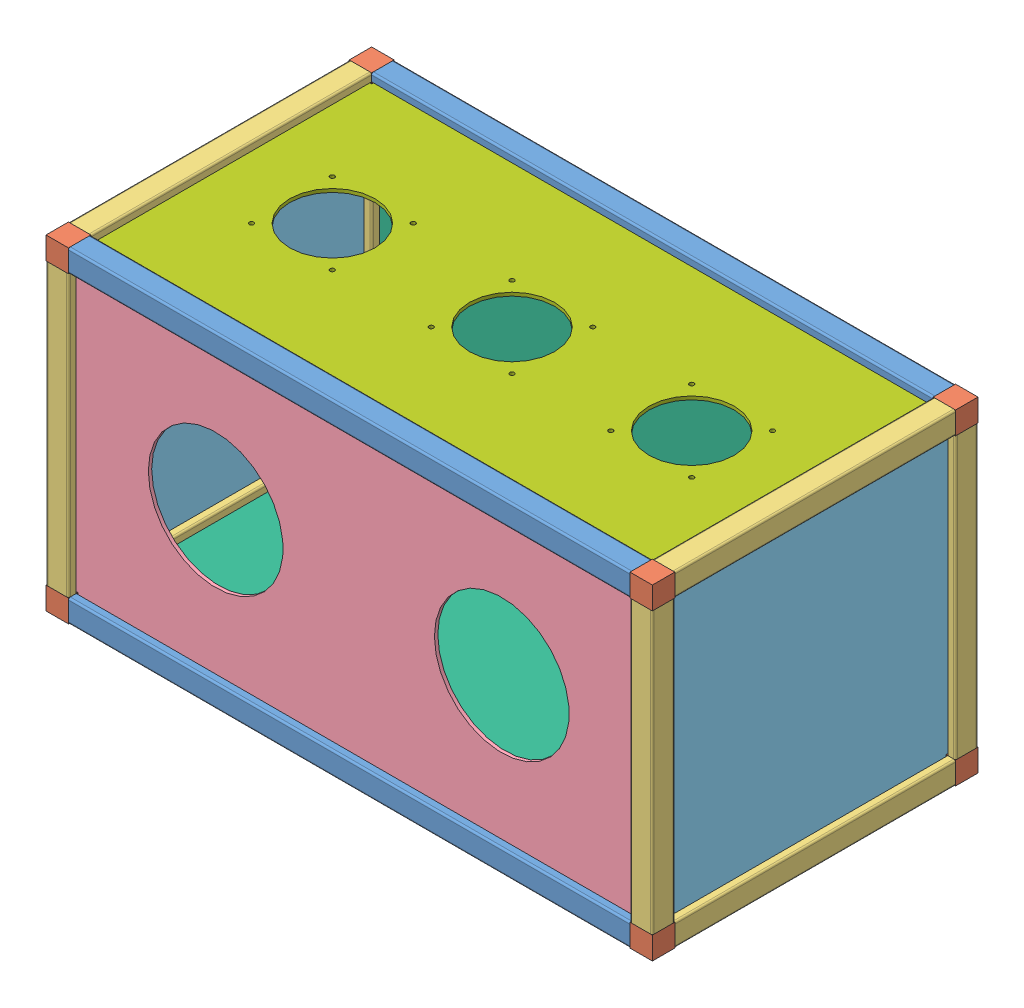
SolidWorks assembly Assy06.SLDASM, configuration Défaut (file format 9000). Lengths in mm.
Overall size (540 290 290).
26 component instances, 7 part files, 78 mates.
Components (placement in the parent):
- Profile20x20x500-1: Profile20x20x500.SLDPRT [Default] at (499 10 -10) x (0 1 0) z (1 0 0) size (20 20 500)
- Cube-1: Cube.SLDPRT [Défaut] at (-10 10 -10) size (26 26 26)
- Cube-2: Cube.SLDPRT [Défaut] at (510 10 -10) x (0 1 0) z (0 0 1) size (26 26 26)
- Profile20x20x250-1: Profile20x20x250.SLDPRT [Default] at (-10 10 -21) x (0 1 0) z (0 0 1) size (20 20 250)
- Profile20x20x250-2: Profile20x20x250.SLDPRT [Default] at (510 10 -21) x (-1 0 0) z (0 0 1) size (20 20 250)
- Cube-3: Cube.SLDPRT [Défaut] at (-10 10 -280) x (0 0 1) z (-1 0 0) size (26 26 26)
- Profile20x20x500-2: Profile20x20x500.SLDPRT [Default] at (1 10 -280) x (0 1 0) z (-1 0 0) size (20 20 500)
- Cube-4: Cube.SLDPRT [Défaut] at (510 10 -280) x (0 0 1) z (0 -1 0) size (26 26 26)
- Profile20x20x250-3: Profile20x20x250.SLDPRT [Default] at (-10 21 -10) x (1 0 0) z (0 -1 0) size (20 20 250)
- Profile20x20x250-4: Profile20x20x250.SLDPRT [Default] at (510 21 -10) x (0 0 -1) z (0 -1 0) size (20 20 250)
- Front-1: Front.SLDPRT [Défaut] at (250 145 -11.5) size (509.6 259.6 3)
- Profile20x20x250-5: Profile20x20x250.SLDPRT [Default] at (-10 21 -280) x (0 0 1) z (0 -1 0) size (20 20 250)
- Profile20x20x250-6: Profile20x20x250.SLDPRT [Default] at (510 21 -280) x (-1 0 0) z (0 -1 0) size (20 20 250)
- Side-1: Side.SLDPRT [Défaut] at (511.5 145 -145) x (0 0 1) z (-1 0 0) size (259.6 259.6 3)
- Side-2: Side.SLDPRT [Défaut] at (-11.5 145 -145) x (0 0 -1) z (1 0 0) size (259.6 259.6 3)
- Panel-1: Panel.SLDPRT [Défaut] at (250 145 -281.5) size (509.6 259.6 3)
- Panel-2: Panel.SLDPRT [Défaut] at (250 11.5 -145) x (1 0 0) z (0 -1 0) size (509.6 259.6 3)
- Cube-5: Cube.SLDPRT [Défaut] at (-10 280 -280) x (0 -1 0) z (-1 0 0) size (26 26 26)
- Cube-6: Cube.SLDPRT [Défaut] at (510 280 -280) x (0 0 1) z (1 0 0) size (26 26 26)
- Cube-7: Cube.SLDPRT [Défaut] at (-10 280 -10) x (0 -1 0) z (0 0 1) size (26 26 26)
- Cube-8: Cube.SLDPRT [Défaut] at (510 280 -10) x (0 -1 0) z (1 0 0) size (26 26 26)
- Profile20x20x250-7: Profile20x20x250.SLDPRT [Default] at (-10 280 -21) size (20 20 250)
- Profile20x20x250-8: Profile20x20x250.SLDPRT [Default] at (510 280 -269) x (-1 0 0) z (0 0 -1) size (20 20 250)
- Profile20x20x500-3: Profile20x20x500.SLDPRT [Default] at (499 280 -10) x (0 0 -1) z (1 0 0) size (20 20 500)
- Profile20x20x500-4: Profile20x20x500.SLDPRT [Default] at (1 280 -280) x (0 0 1) z (-1 0 0) size (20 20 500)
- Top-1: Top.SLDPRT [Défaut] at (250 278.5 -145) x (1 0 0) z (0 1 0) size (509.6 259.6 3)
Mates (geometry in assembly coordinates):
- Coïncidente1: coincident aligned: plane of Profile20x20x500-1 through (0 18.4 0) normal (0 0 1); plane of assembly through (0 0 0) normal (0 0 1)
- Coïncidente2: coincident anti-aligned: plane of Profile20x20x500-1 through (0 0 -1.6) normal (0 -1 0); plane of assembly through (0 0 0) normal (0 1 0)
- Coïncidente4: coincident anti-aligned: plane of Profile20x20x500-1 through (0 1.6 -1.6) normal (-1 0 0); plane of assembly through (0 0 0) normal (1 0 0)
- Coïncidente5: coincident aligned: plane of Profile20x20x500-1 through (0 18.4 0) normal (0 0 1); plane of Cube-1 through (-10 10 0) normal (0 0 1)
- Coïncidente6: coincident aligned: plane of Profile20x20x500-1 through (0 0 -1.6) normal (0 -1 0); plane of Cube-1 through (-20 0 -20) normal (0 -1 0)
- Distance2: distance anti-aligned: plane of Cube-1 through (0 0 -20) normal (1 0 0); plane of Profile20x20x500-1 through (0 1.6 -1.6) normal (-1 0 0)
- Distance3: distance anti-aligned: plane of Cube-2 through (500 0 -20) normal (-1 0 0); plane of Profile20x20x500-1 through (500 1.6 -1.6) normal (1 0 0)
- Coïncidente9: coincident aligned: plane of Profile20x20x500-1 through (0 18.4 0) normal (0 0 1); plane of Cube-2 through (510 10 0) normal (0 0 1)
- Coïncidente10: coincident aligned: plane of Profile20x20x500-1 through (0 0 -1.6) normal (0 -1 0); plane of Cube-2 through (520 0 -20) normal (0 -1 0)
- Coïncidente11: coincident aligned: plane of Cube-1 through (-20 0 -20) normal (-1 0 0); plane of Profile20x20x250-1 through (-20 18.4 -270) normal (-1 0 0)
- Coïncidente12: coincident aligned: plane of Cube-1 through (-20 0 -20) normal (0 -1 0); plane of Profile20x20x250-1 through (-18.4 0 -270) normal (0 -1 0)
- Distance4: distance anti-aligned: plane of Profile20x20x250-1 through (-18.4 1.6 -20) normal (0 0 1); plane of Cube-1 through (-10 10 -20) normal (0 0 -1)
- Distance5: distance anti-aligned: plane of Profile20x20x250-2 through (518.4 1.6 -20) normal (0 0 1); plane of Cube-2 through (510 10 -20) normal (0 0 -1)
- Coïncidente16: coincident aligned: plane of Cube-2 through (520 0 -20) normal (0 -1 0); plane of Profile20x20x250-2 through (501.6 0 -270) normal (0 -1 0)
- Coïncidente17: coincident aligned: plane of Cube-2 through (520 0 -20) normal (1 0 0); plane of Profile20x20x250-2 through (520 1.6 -270) normal (1 0 0)
- Coïncidente18: coincident anti-aligned: plane of Profile20x20x500-2 through (500 0 -288.4) normal (0 -1 0); plane of assembly through (0 0 0) normal (0 1 0)
- Distance10: distance anti-aligned: plane of Cube-3 through (0 10 -280) normal (1 0 0); plane of Profile20x20x500-2 through (0 1.6 -288.4) normal (-1 0 0)
- Coïncidente20: coincident aligned: plane of Cube-3 through (0 0 -290) normal (0 0 -1); plane of Profile20x20x500-2 through (500 18.4 -290) normal (0 0 -1)
- Coïncidente21: coincident aligned: plane of Cube-3 through (0 0 -290) normal (0 -1 0); plane of Profile20x20x500-2 through (500 0 -288.4) normal (0 -1 0)
- Distance6: distance = 0.0305 mm anti-aligned: plane of Cube-3 through (0 0 -270) normal (0 0 1); plane of Profile20x20x250-1 through (-18.4 1.6 -270) normal (0 0 -1)
- Coïncidente23: coincident aligned: plane of Profile20x20x250-1 through (-20 18.4 -270) normal (-1 0 0); plane of Cube-3 through (-20 10 -280) normal (-1 0 0)
- Distance11: distance anti-aligned: plane of Profile20x20x500-2 through (500 1.6 -288.4) normal (1 0 0); plane of Cube-4 through (500 20 -290) normal (-1 0 0)
- Distance9: distance anti-aligned: plane of Profile20x20x250-2 through (518.4 1.6 -270) normal (0 0 -1); plane of Cube-4 through (520 20 -270) normal (0 0 1)
- Coïncidente26: coincident aligned: plane of Profile20x20x500-2 through (500 0 -288.4) normal (0 -1 0); plane of Cube-4 through (510 0 -280) normal (0 -1 0)
- Distance12: distance anti-aligned: plane of Cube-1 through (-20 20 -20) normal (0 1 0); plane of Profile20x20x250-3 through (-18.4 20 -1.6) normal (0 -1 0)
- Coïncidente28: coincident aligned: plane of Cube-1 through (-10 10 0) normal (0 0 1); plane of Profile20x20x250-3 through (-1.6 270 0) normal (0 0 1)
- Coïncidente29: coincident aligned: plane of Cube-1 through (-20 0 -20) normal (-1 0 0); plane of Profile20x20x250-3 through (-20 270 -1.6) normal (-1 0 0)
- Distance7: distance anti-aligned: plane of Profile20x20x250-4 through (518.4 20 -1.6) normal (0 -1 0); plane of Cube-2 through (520 20 -20) normal (0 1 0)
- Coïncidente33: coincident aligned: plane of Cube-2 through (520 0 -20) normal (1 0 0); plane of Profile20x20x250-4 through (520 270 -18.4) normal (1 0 0)
- Coïncidente34: coincident aligned: plane of Cube-2 through (510 10 0) normal (0 0 1); plane of Profile20x20x250-4 through (518.4 270 0) normal (0 0 1)
- Coïncidente35: coincident anti-aligned: plane of Cube-2 through (504.8 20 -8.5) normal (-1 0 0); plane of Front-1 through (504.8 15.2 -8.5) normal (1 0 0)
- Distance8: distance anti-aligned: plane of Front-1 through (-4.8 15.2 -8.5) normal (0 -1 0); plane of Cube-2 through (500 15.2 -8.5) normal (0 1 0)
- Coïncidente37: coincident anti-aligned: plane of Cube-2 through (510 10 -11.5) normal (0 0 1); plane of Front-1 through (250 145 -11.5) normal (0 0 -1)
- Distance13: distance anti-aligned: plane of Profile20x20x250-5 through (-18.4 20 -288.4) normal (0 -1 0); plane of Cube-3 through (0 20 -290) normal (0 1 0)
- Coïncidente39: coincident aligned: plane of Cube-3 through (-20 10 -280) normal (-1 0 0); plane of Profile20x20x250-5 through (-20 270 -271.6) normal (-1 0 0)
- Coïncidente40: coincident aligned: plane of Cube-3 through (0 0 -290) normal (0 0 -1); plane of Profile20x20x250-5 through (-18.4 270 -290) normal (0 0 -1)
- Distance14: distance anti-aligned: plane of Cube-4 through (510 20 -280) normal (0 1 0); plane of Profile20x20x250-6 through (518.4 20 -288.4) normal (0 -1 0)
- Coïncidente42: coincident aligned: plane of Cube-4 through (520 20 -290) normal (0 0 -1); plane of Profile20x20x250-6 through (501.6 270 -290) normal (0 0 -1)
- Coïncidente43: coincident aligned: plane of Cube-4 through (520 20 -290) normal (1 0 0); plane of Profile20x20x250-6 through (520 270 -288.4) normal (1 0 0)
- Coïncidente44: coincident anti-aligned: plane of Cube-2 through (508.5 20 -15.2) normal (0 0 -1); plane of Side-1 through (508.5 15.2 -15.2) normal (0 0 1)
- Coïncidente45: coincident anti-aligned: plane of Cube-2 through (511.5 10 -10) normal (-1 0 0); plane of Side-1 through (511.5 145 -145) normal (1 0 0)
- Distance15: distance anti-aligned: plane of Side-1 through (508.5 15.2 -274.8) normal (0 -1 0); plane of Cube-2 through (508.5 15.2 -20) normal (0 1 0)
- Coïncidente47: coincident anti-aligned: plane of Cube-1 through (-8.5 20 -15.2) normal (0 0 -1); plane of Side-2 through (-8.5 15.2 -15.2) normal (0 0 1)
- Coïncidente48: coincident anti-aligned: plane of Cube-1 through (-11.5 10 -10) normal (1 0 0); plane of Side-2 through (-11.5 145 -145) normal (-1 0 0)
- Distance16: distance anti-aligned: plane of Side-2 through (-8.5 15.2 -15.2) normal (0 -1 0); plane of Cube-1 through (-8.5 15.2 -20) normal (0 1 0)
- Coïncidente50: coincident anti-aligned: plane of Cube-4 through (504.8 20 -278.5) normal (-1 0 0); plane of Panel-1 through (504.8 15.2 -278.5) normal (1 0 0)
- Coïncidente51: coincident anti-aligned: plane of Cube-4 through (510 10 -281.5) normal (0 0 1); plane of Panel-1 through (250 145 -281.5) normal (0 0 -1)
- Distance17: distance anti-aligned: plane of Panel-1 through (-4.8 15.2 -278.5) normal (0 -1 0); plane of Cube-4 through (500 15.2 -278.5) normal (0 1 0)
- Coïncidente53: coincident anti-aligned: plane of Cube-1 through (-4.8 11.5 -20) normal (1 0 0); plane of Panel-2 through (-4.8 8.5 -274.8) normal (-1 0 0)
- Coïncidente54: coincident anti-aligned: plane of Cube-1 through (-10 11.5 -10) normal (0 -1 0); plane of Panel-2 through (250 11.5 -145) normal (0 1 0)
- Distance18: distance anti-aligned: plane of Panel-2 through (-4.8 8.5 -15.2) normal (0 0 1); plane of Cube-1 through (0 11.5 -15.2) normal (0 0 -1)
- Distance19: distance anti-aligned: plane of Cube-5 through (0 270 -290) normal (0 -1 0); plane of Profile20x20x250-5 through (-18.4 270 -288.4) normal (0 1 0)
- Coïncidente57: coincident aligned: plane of Profile20x20x250-5 through (-20 270 -271.6) normal (-1 0 0); plane of Cube-5 through (-20 280 -280) normal (-1 0 0)
- Coïncidente58: coincident aligned: plane of Profile20x20x250-5 through (-18.4 270 -290) normal (0 0 -1); plane of Cube-5 through (0 290 -290) normal (0 0 -1)
- Distance20: distance anti-aligned: plane of Profile20x20x250-6 through (518.4 270 -288.4) normal (0 1 0); plane of Cube-6 through (500 270 -290) normal (0 -1 0)
- Coïncidente60: coincident aligned: plane of Profile20x20x250-6 through (520 270 -288.4) normal (1 0 0); plane of Cube-6 through (520 280 -280) normal (1 0 0)
- Coïncidente61: coincident aligned: plane of Profile20x20x250-6 through (501.6 270 -290) normal (0 0 -1); plane of Cube-6 through (500 290 -290) normal (0 0 -1)
- Distance21: distance anti-aligned: plane of Profile20x20x250-3 through (-18.4 270 -1.6) normal (0 1 0); plane of Cube-7 through (-20 270 -20) normal (0 -1 0)
- Coïncidente63: coincident aligned: plane of Profile20x20x250-3 through (-1.6 270 0) normal (0 0 1); plane of Cube-7 through (-10 280 0) normal (0 0 1)
- Coïncidente64: coincident aligned: plane of Profile20x20x250-3 through (-20 270 -1.6) normal (-1 0 0); plane of Cube-7 through (-20 290 -20) normal (-1 0 0)
- Distance22: distance anti-aligned: plane of Cube-8 through (500 270 0) normal (0 -1 0); plane of Profile20x20x250-4 through (518.4 270 -1.6) normal (0 1 0)
- Coïncidente66: coincident aligned: plane of Profile20x20x250-4 through (520 270 -18.4) normal (1 0 0); plane of Cube-8 through (520 280 -10) normal (1 0 0)
- Coïncidente67: coincident aligned: plane of Profile20x20x250-4 through (518.4 270 0) normal (0 0 1); plane of Cube-8 through (500 290 0) normal (0 0 1)
- Distance23: distance anti-aligned: plane of Profile20x20x250-7 through (-18.4 288.4 -20) normal (0 0 1); plane of Cube-7 through (-10 280 -20) normal (0 0 -1)
- Coïncidente69: coincident aligned: plane of Cube-7 through (-20 290 -20) normal (0 1 0); plane of Profile20x20x250-7 through (-1.6 290 -270) normal (0 1 0)
- Coïncidente70: coincident aligned: plane of Cube-7 through (-20 290 -20) normal (-1 0 0); plane of Profile20x20x250-7 through (-20 288.4 -270) normal (-1 0 0)
- Distance24: distance anti-aligned: plane of Profile20x20x250-8 through (518.4 288.4 -270) normal (0 0 -1); plane of Cube-6 through (500 290 -270) normal (0 0 1)
- Coïncidente72: coincident aligned: plane of Cube-6 through (520 280 -280) normal (1 0 0); plane of Profile20x20x250-8 through (520 288.4 -20) normal (1 0 0)
- Coïncidente73: coincident aligned: plane of Cube-6 through (500 290 -290) normal (0 1 0); plane of Profile20x20x250-8 through (501.6 290 -20) normal (0 1 0)
- Distance25: distance anti-aligned: plane of Profile20x20x500-3 through (0 288.4 -1.6) normal (-1 0 0); plane of Cube-7 through (0 290 -20) normal (1 0 0)
- Coïncidente75: coincident aligned: plane of Cube-7 through (-10 280 0) normal (0 0 1); plane of Profile20x20x500-3 through (0 288.4 0) normal (0 0 1)
- Coïncidente76: coincident aligned: plane of Cube-7 through (-20 290 -20) normal (0 1 0); plane of Profile20x20x500-3 through (0 290 -18.4) normal (0 1 0)
- Distance26: distance anti-aligned: plane of Profile20x20x500-4 through (0 288.4 -288.4) normal (-1 0 0); plane of Cube-5 through (0 280 -280) normal (1 0 0)
- Coïncidente78: coincident aligned: plane of Cube-5 through (0 290 -290) normal (0 1 0); plane of Profile20x20x500-4 through (500 290 -271.6) normal (0 1 0)
- Coïncidente79: coincident aligned: plane of Cube-5 through (0 290 -290) normal (0 0 -1); plane of Profile20x20x500-4 through (500 288.4 -290) normal (0 0 -1)
- Coïncidente80: coincident anti-aligned: plane of Cube-7 through (-4.8 278.5 -20) normal (1 0 0); plane of Top-1 through (-4.8 281.5 -15.2) normal (-1 0 0)
- Coïncidente81: coincident anti-aligned: plane of Cube-7 through (-10 281.5 -10) normal (0 -1 0); plane of Top-1 through (250 281.5 -145) normal (0 1 0)
- Coïncidente82: coincident anti-aligned: plane of Cube-7 through (0 278.5 -15.2) normal (0 0 -1); plane of Top-1 through (-4.8 281.5 -15.2) normal (0 0 1)
